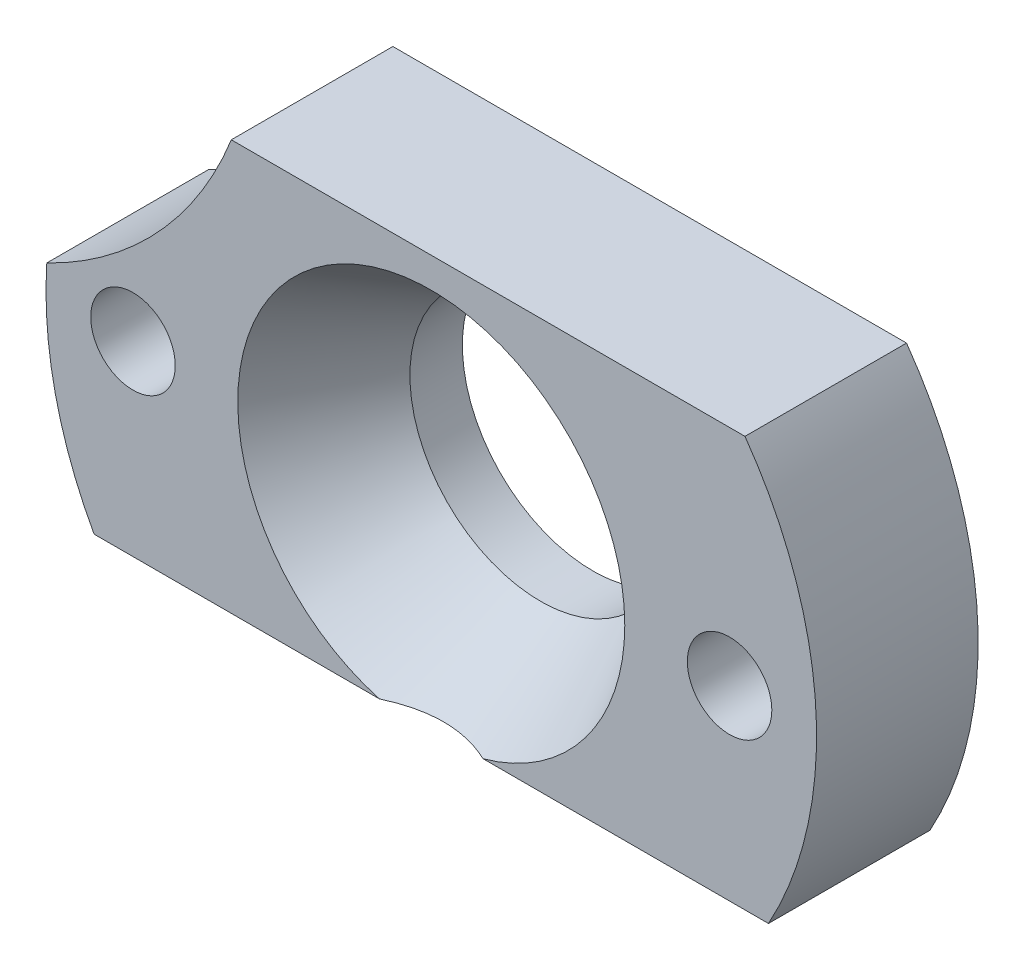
from build123d import *

# Parameters (mm, degrees)
LINEAR_AUSTRAGEN1_DEPTH          = 6.5
F_3_4_3_4_DURCHMESSER_BOHRUNG1_D = 3.4
SKIZZE7_R                        = 15
SCHNITT_LINEAR_AUSTRAGEN1_DEPTH  = 20.065675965


with BuildPart() as part:
    # Skizze1 → Linear austragen1 (new body)
    with BuildSketch(Plane.XY):
        with BuildLine():
            Line((13.564659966, -7.5), (-13.564659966, -7.5))
            ThreePointArc((-13.564659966, -7.5), (-15.474628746, 0.88649037), (-12.619429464, 9))
            Line((-12.619429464, 9), (12.619429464, 9))
            ThreePointArc((12.619429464, 9), (15.474628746, 0.88649037), (13.564659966, -7.5))
        make_face()
    extrude(amount=LINEAR_AUSTRAGEN1_DEPTH)

    # 3.4 _3.4_ Durchmesser Bohrung1 (through all)
    with Locations(Plane.XY.offset(6.5)):
        with Locations((-12, 0), (12, 0)):
            Hole(F_3_4_3_4_DURCHMESSER_BOHRUNG1_D / 2)

    # Skizze4 → Formsenkung f_r M1.6 Linsensenkschraube (revolve, cut)
    with BuildSketch(Plane(origin=(0, 0, 6.5), x_dir=(0, -1, 0), z_dir=(1, 0, 0))):
        Polygon((0, 0), (0, 6.5), (5.25, 6.5), (5.25, 4.39), (7.784567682, 0), align=None)
    revolve(axis=Axis((0, 0, 12.85), (0, 0, -1)), mode=Mode.SUBTRACT)

    # Skizze7 → Schnitt-Linear austragen1 (cut, through all)
    with BuildSketch(Plane(origin=(0, 0, 0), x_dir=(-1, 0, 0), z_dir=(0, 0, -1))):
        with Locations((22, 14.5)):
            Circle(SKIZZE7_R)
    extrude(amount=-SCHNITT_LINEAR_AUSTRAGEN1_DEPTH, mode=Mode.SUBTRACT)


solid = part.part
